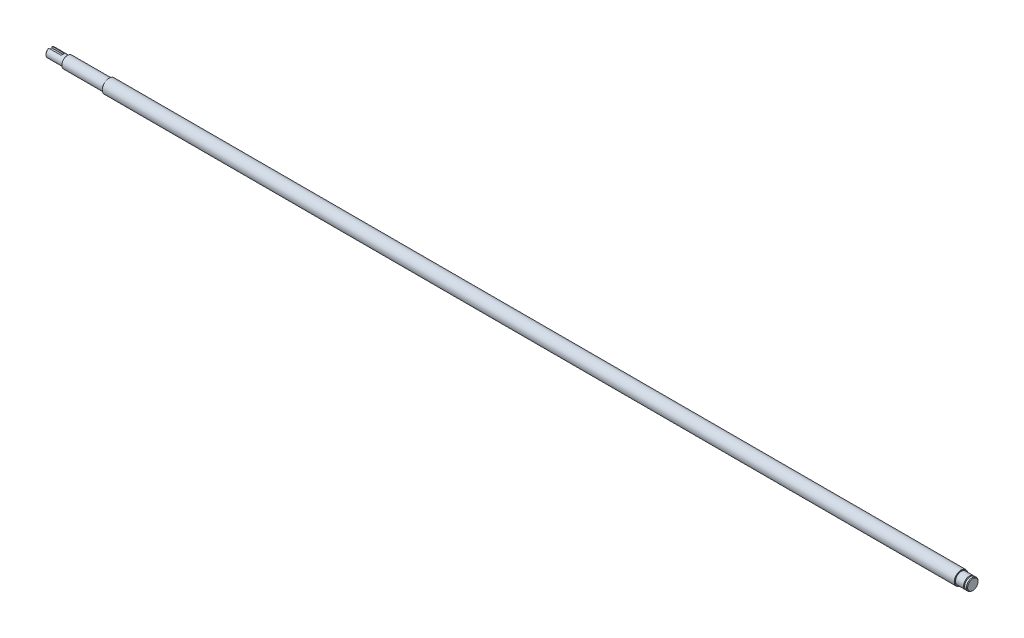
from build123d import *

# Parameters (mm, degrees)
CHAMFER1_SIZE      = 0.5
CHAMFER2_SIZE      = 0.2
CUT_EXTRUDE1_DEPTH = 4


with BuildPart() as part:
    # Sketch1 → Revolve1 (revolve)
    with BuildSketch(Plane.XY, mode=Mode.PRIVATE) as revolve1_sk:
        Polygon((0, 0), (800, 0), (800, 5), (797.9, 5), (797.9, 3.8), (797, 3.8), (797, 5), (790, 5), (790, 5.9), (51, 5.9), (51, 5), (15, 5), (15, 4), (0, 4), align=None)
    revolve(revolve1_sk.sketch.rotate(Axis((0, 0, 0), (1, 0, 0)), 90), axis=Axis((0, 0, 0), (1, 0, 0)))

    # Chamfer1
    chamfer1_edges = [part.edges().sort_by_distance(p)[0] for p in [
        (800, 0, -5),
        (0, 0, -4),
    ]]
    chamfer(chamfer1_edges, length=CHAMFER1_SIZE)

    # Chamfer2
    chamfer2_edges = [part.edges().sort_by_distance(p)[0] for p in [
        (790, 0, -5.9),
        (51, 0, -5.9),
        (15, 0, -5),
    ]]
    chamfer(chamfer2_edges, length=CHAMFER2_SIZE)

    # Sketch5 → Cut-Extrude1 (cut)
    with BuildSketch(Plane(origin=(0, 2.2, 0), x_dir=(1, 0, 0), z_dir=(0, 1, 0))):
        with BuildLine():
            Line((0, 1.5), (10, 1.5))
            ThreePointArc((10, 1.5), (11.5, 0), (10, -1.5))
            Line((10, -1.5), (0, -1.5))
            Line((0, -1.5), (0, 1.5))
        make_face()
    extrude(amount=CUT_EXTRUDE1_DEPTH, mode=Mode.SUBTRACT)


solid = part.part
